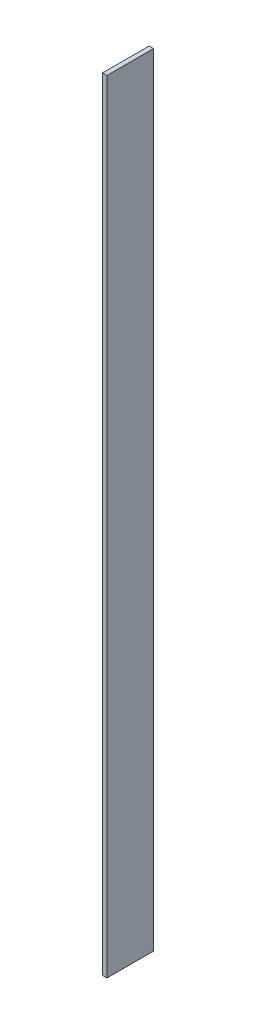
ISO-10303-21;
HEADER;
FILE_DESCRIPTION(('STEP AP214'),'2;1');
FILE_NAME('part.step','',(''),(''),'','','');
FILE_SCHEMA(('AUTOMOTIVE_DESIGN { 1 0 10303 214 1 1 1 1 }'));
ENDSEC;
DATA;
#1=APPLICATION_CONTEXT('core data for automotive mechanical design processes');
#2=APPLICATION_PROTOCOL_DEFINITION('international standard','automotive_design',2000,#1);
#3=PRODUCT_CONTEXT('',#1,'mechanical');
#4=PRODUCT('Part','Part','',(#3));
#5=PRODUCT_RELATED_PRODUCT_CATEGORY('part','',(#4));
#6=PRODUCT_DEFINITION_FORMATION('','',#4);
#7=PRODUCT_DEFINITION_CONTEXT('part definition',#1,'design');
#8=PRODUCT_DEFINITION('design','',#6,#7);
#9=PRODUCT_DEFINITION_SHAPE('','',#8);
#10=(LENGTH_UNIT() NAMED_UNIT(*) SI_UNIT(.MILLI.,.METRE.));
#11=(NAMED_UNIT(*) PLANE_ANGLE_UNIT() SI_UNIT($,.RADIAN.));
#12=(NAMED_UNIT(*) SI_UNIT($,.STERADIAN.) SOLID_ANGLE_UNIT());
#13=UNCERTAINTY_MEASURE_WITH_UNIT(LENGTH_MEASURE(1.E-05),#10,'distance_accuracy_value','');
#14=(GEOMETRIC_REPRESENTATION_CONTEXT(3) GLOBAL_UNCERTAINTY_ASSIGNED_CONTEXT((#13)) GLOBAL_UNIT_ASSIGNED_CONTEXT((#10,
#11,#12)) REPRESENTATION_CONTEXT('',''));
#15=CARTESIAN_POINT('',(0.,0.,0.));
#16=DIRECTION('',(0.,0.,1.));
#17=DIRECTION('',(1.,0.,0.));
#18=AXIS2_PLACEMENT_3D('',#15,#16,#17);
#19=CARTESIAN_POINT('',(35.0050551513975,-7.32000617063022E-05,-91.4503039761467));
#20=DIRECTION('',(-0.999999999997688,2.0911281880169E-06,-5.01871174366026E-07));
#21=DIRECTION('',(-2.09112818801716E-06,-0.999999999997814,0.));
#22=AXIS2_PLACEMENT_3D('',#19,#20,#21);
#23=PLANE('',#22);
#24=DIRECTION('',(5.01871174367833E-07,-1.04862355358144E-12,-0.999999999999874));
#25=VECTOR('',#24,1.);
#26=CARTESIAN_POINT('',(34.9941812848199,-5200.00007318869,-91.4503039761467));
#27=LINE('',#26,#25);
#28=CARTESIAN_POINT('',(34.9941812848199,-5200.00007318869,-91.4503039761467));
#29=VERTEX_POINT('',#28);
#30=CARTESIAN_POINT('',(34.9943368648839,-5200.00007318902,-401.450303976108));
#31=VERTEX_POINT('',#30);
#32=EDGE_CURVE('E68',#29,#31,#27,.T.);
#33=ORIENTED_EDGE('',*,*,#32,.F.);
#34=DIRECTION('',(-2.09112818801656E-06,-0.999999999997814,0.));
#35=VECTOR('',#34,1.);
#36=CARTESIAN_POINT('',(35.0050551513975,-7.32000617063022E-05,-91.4503039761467));
#37=LINE('',#36,#35);
#38=CARTESIAN_POINT('',(35.0050551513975,-7.32000618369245E-05,-91.4503039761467));
#39=VERTEX_POINT('',#38);
#40=EDGE_CURVE('E55',#39,#29,#37,.T.);
#41=ORIENTED_EDGE('',*,*,#40,.F.);
#42=DIRECTION('',(-5.01871174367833E-07,1.04947696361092E-12,0.999999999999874));
#43=VECTOR('',#42,1.);
#44=CARTESIAN_POINT('',(35.0052107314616,-7.32003873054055E-05,-401.450303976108));
#45=LINE('',#44,#43);
#46=CARTESIAN_POINT('',(35.0052107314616,-7.32003873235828E-05,-401.450303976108));
#47=VERTEX_POINT('',#46);
#48=EDGE_CURVE('E20',#47,#39,#45,.T.);
#49=ORIENTED_EDGE('',*,*,#48,.F.);
#50=DIRECTION('',(2.09112818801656E-06,0.999999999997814,0.));
#51=VECTOR('',#50,1.);
#52=CARTESIAN_POINT('',(34.9943368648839,-5200.00007318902,-401.450303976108));
#53=LINE('',#52,#51);
#54=EDGE_CURVE('E81',#31,#47,#53,.T.);
#55=ORIENTED_EDGE('',*,*,#54,.F.);
#56=EDGE_LOOP('',(#33,#41,#49,#55));
#57=FACE_BOUND('',#56,.T.);
#58=ADVANCED_FACE('F17',(#57),#23,.T.);
#59=CARTESIAN_POINT('',(35.0052107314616,-7.32003873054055E-05,-401.450303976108));
#60=DIRECTION('',(2.09112819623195E-06,0.999999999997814,0.));
#61=DIRECTION('',(-0.999999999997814,2.09112819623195E-06,0.));
#62=AXIS2_PLACEMENT_3D('',#59,#60,#61);
#63=PLANE('',#62);
#64=DIRECTION('',(-5.01871174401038E-07,1.04947695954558E-12,0.999999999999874));
#65=VECTOR('',#64,1.);
#66=CARTESIAN_POINT('',(65.0052107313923,-0.000135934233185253,-401.450288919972));
#67=LINE('',#66,#65);
#68=CARTESIAN_POINT('',(65.0052107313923,-0.000135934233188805,-401.450288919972));
#69=VERTEX_POINT('',#68);
#70=CARTESIAN_POINT('',(65.0050551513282,-0.000135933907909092,-91.4502889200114));
#71=VERTEX_POINT('',#70);
#72=EDGE_CURVE('E83',#69,#71,#67,.T.);
#73=ORIENTED_EDGE('',*,*,#72,.F.);
#74=DIRECTION('',(0.999999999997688,-2.09112819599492E-06,5.01871174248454E-07));
#75=VECTOR('',#74,1.);
#76=CARTESIAN_POINT('',(35.0052107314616,-7.32003873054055E-05,-401.450303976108));
#77=LINE('',#76,#75);
#78=EDGE_CURVE('E64',#47,#69,#77,.T.);
#79=ORIENTED_EDGE('',*,*,#78,.F.);
#80=ORIENTED_EDGE('',*,*,#48,.T.);
#81=DIRECTION('',(-0.999999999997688,2.09112819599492E-06,-5.01871174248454E-07));
#82=VECTOR('',#81,1.);
#83=CARTESIAN_POINT('',(65.0050551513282,-0.00013593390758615,-91.4502889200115));
#84=LINE('',#83,#82);
#85=EDGE_CURVE('E61',#71,#39,#84,.T.);
#86=ORIENTED_EDGE('',*,*,#85,.F.);
#87=EDGE_LOOP('',(#73,#79,#80,#86));
#88=FACE_BOUND('',#87,.T.);
#89=ADVANCED_FACE('F60',(#88),#63,.T.);
#90=CARTESIAN_POINT('',(65.0050551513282,-0.00013593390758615,-91.4502889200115));
#91=DIRECTION('',(-5.01871174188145E-07,1.04947695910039E-12,0.999999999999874));
#92=DIRECTION('',(0.999999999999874,0.,5.01871174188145E-07));
#93=AXIS2_PLACEMENT_3D('',#90,#91,#92);
#94=PLANE('',#93);
#95=DIRECTION('',(-0.999999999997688,2.09112818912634E-06,-5.01871174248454E-07));
#96=VECTOR('',#95,1.);
#97=CARTESIAN_POINT('',(64.9941812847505,-5200.00013592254,-91.4502889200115));
#98=LINE('',#97,#96);
#99=CARTESIAN_POINT('',(64.9941812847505,-5200.00013592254,-91.4502889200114));
#100=VERTEX_POINT('',#99);
#101=EDGE_CURVE('E70',#100,#29,#98,.T.);
#102=ORIENTED_EDGE('',*,*,#101,.F.);
#103=DIRECTION('',(2.09112818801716E-06,0.999999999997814,0.));
#104=VECTOR('',#103,1.);
#105=CARTESIAN_POINT('',(65.0050551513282,-0.000135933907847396,-91.4502889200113));
#106=LINE('',#105,#104);
#107=EDGE_CURVE('E74',#71,#100,#106,.F.);
#108=ORIENTED_EDGE('',*,*,#107,.F.);
#109=ORIENTED_EDGE('',*,*,#85,.T.);
#110=ORIENTED_EDGE('',*,*,#40,.T.);
#111=EDGE_LOOP('',(#102,#108,#109,#110));
#112=FACE_BOUND('',#111,.T.);
#113=ADVANCED_FACE('F72',(#112),#94,.T.);
#114=CARTESIAN_POINT('',(64.9941812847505,-5200.00013592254,-91.4502889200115));
#115=DIRECTION('',(-2.09112818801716E-06,-0.999999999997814,0.));
#116=DIRECTION('',(0.999999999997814,-2.09112818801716E-06,0.));
#117=AXIS2_PLACEMENT_3D('',#114,#115,#116);
#118=PLANE('',#117);
#119=DIRECTION('',(-0.999999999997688,2.09112818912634E-06,-5.01871174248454E-07));
#120=VECTOR('',#119,1.);
#121=CARTESIAN_POINT('',(64.9943368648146,-5200.00013592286,-401.450288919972));
#122=LINE('',#121,#120);
#123=CARTESIAN_POINT('',(64.9943368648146,-5200.00013592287,-401.450288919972));
#124=VERTEX_POINT('',#123);
#125=EDGE_CURVE('E35',#124,#31,#122,.T.);
#126=ORIENTED_EDGE('',*,*,#125,.F.);
#127=DIRECTION('',(-5.01871174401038E-07,1.04947695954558E-12,0.999999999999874));
#128=VECTOR('',#127,1.);
#129=CARTESIAN_POINT('',(64.9943368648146,-5200.00013592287,-401.450288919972));
#130=LINE('',#129,#128);
#131=EDGE_CURVE('E26',#100,#124,#130,.F.);
#132=ORIENTED_EDGE('',*,*,#131,.F.);
#133=ORIENTED_EDGE('',*,*,#101,.T.);
#134=ORIENTED_EDGE('',*,*,#32,.T.);
#135=EDGE_LOOP('',(#126,#132,#133,#134));
#136=FACE_BOUND('',#135,.T.);
#137=ADVANCED_FACE('F89',(#136),#118,.T.);
#138=CARTESIAN_POINT('',(35.0052107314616,-7.32003873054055E-05,-401.450303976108));
#139=DIRECTION('',(5.01871174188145E-07,-1.04947695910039E-12,-0.999999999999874));
#140=DIRECTION('',(-0.999999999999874,0.,-5.01871174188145E-07));
#141=AXIS2_PLACEMENT_3D('',#138,#139,#140);
#142=PLANE('',#141);
#143=ORIENTED_EDGE('',*,*,#125,.T.);
#144=ORIENTED_EDGE('',*,*,#54,.T.);
#145=ORIENTED_EDGE('',*,*,#78,.T.);
#146=DIRECTION('',(2.09112818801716E-06,0.999999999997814,0.));
#147=VECTOR('',#146,1.);
#148=CARTESIAN_POINT('',(65.0052107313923,-0.000135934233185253,-401.450288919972));
#149=LINE('',#148,#147);
#150=EDGE_CURVE('E11',#124,#69,#149,.T.);
#151=ORIENTED_EDGE('',*,*,#150,.F.);
#152=EDGE_LOOP('',(#143,#144,#145,#151));
#153=FACE_BOUND('',#152,.T.);
#154=ADVANCED_FACE('F91',(#153),#142,.T.);
#155=CARTESIAN_POINT('',(65.0052107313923,-0.000135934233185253,-401.450288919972));
#156=DIRECTION('',(0.999999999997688,-2.0911281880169E-06,5.01871174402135E-07));
#157=DIRECTION('',(2.09112818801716E-06,0.999999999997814,0.));
#158=AXIS2_PLACEMENT_3D('',#155,#156,#157);
#159=PLANE('',#158);
#160=ORIENTED_EDGE('',*,*,#131,.T.);
#161=ORIENTED_EDGE('',*,*,#150,.T.);
#162=ORIENTED_EDGE('',*,*,#72,.T.);
#163=ORIENTED_EDGE('',*,*,#107,.T.);
#164=EDGE_LOOP('',(#160,#161,#162,#163));
#165=FACE_BOUND('',#164,.T.);
#166=ADVANCED_FACE('F88',(#165),#159,.T.);
#167=CLOSED_SHELL('',(#58,#89,#113,#137,#154,#166));
#168=MANIFOLD_SOLID_BREP('B1',#167);
#169=ADVANCED_BREP_SHAPE_REPRESENTATION('',(#18,#168),#14);
#170=SHAPE_DEFINITION_REPRESENTATION(#9,#169);
ENDSEC;
END-ISO-10303-21;
